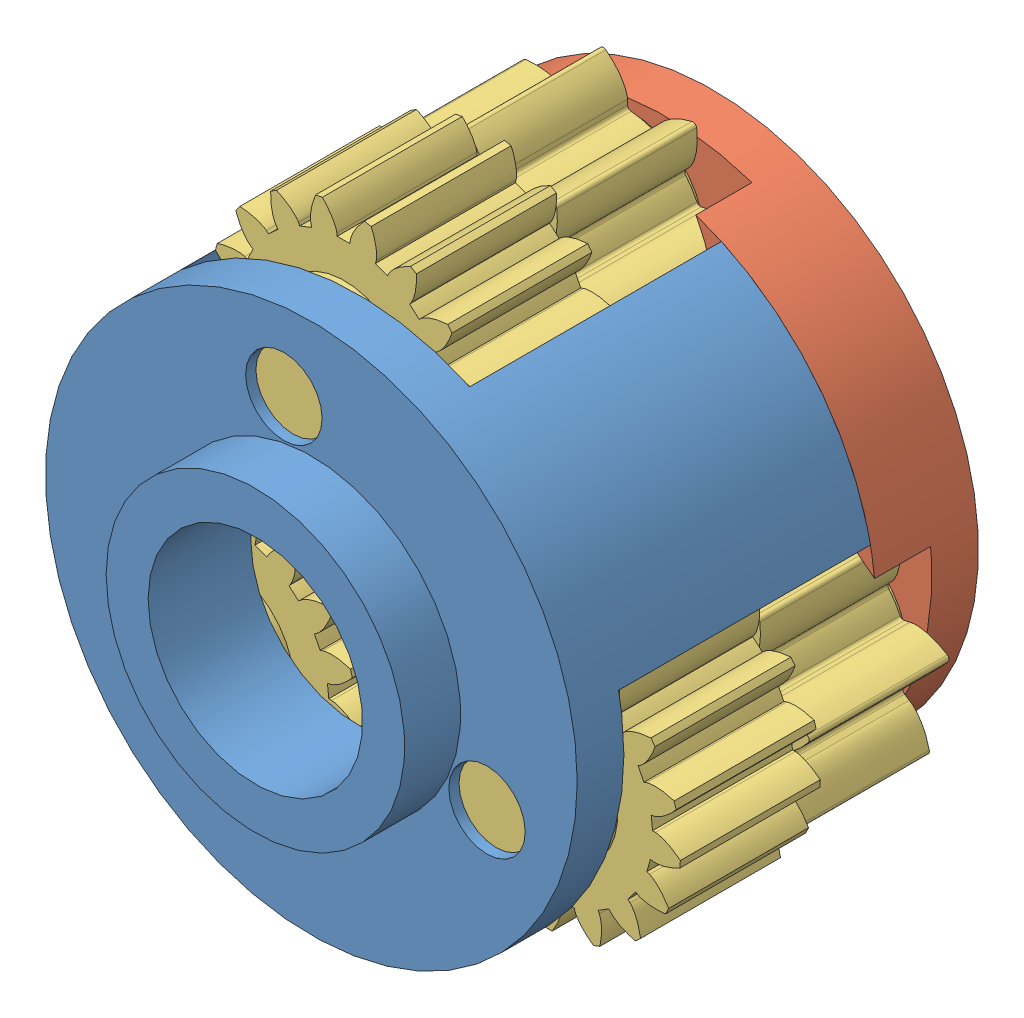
SolidWorks assembly Train Epicycloidale.SLDASM, configuration Default (file format 11000). Lengths in mm.
Overall size (6.31 6.26 5).
5 component instances, 3 part files, 9 mates.
Components (placement in the parent):
- porte satellite1-1: porte satellite1.SLDPRT [Défaut] at (-4.347 -5.3728 1.7604) size (5.7 5.7 5)
- porte satellite 2a-1: porte satellite 2a.SLDPRT [Défaut] at (-4.347 -5.3728 1.7604) size (5.7 5.7 1.1)
- SATELITE17X8a-1: SATELITE17X8a.SLDPRT [Défaut] at (-4.347 -5.3728 1.7604) size (2.84 2.83 4.1)
- SATELITE17X8a-2: SATELITE17X8a.SLDPRT [Défaut] at (-7.817 -5.8833 1.7604) size (2.84 2.83 4.1)
- SATELITE17X8a-3: SATELITE17X8a.SLDPRT [Défaut] at (-6.5241 -2.6229 1.7604) size (2.84 2.83 4.1)
Mates (geometry in assembly coordinates):
- Coaxiale1: concentric: cylinder of porte satellite1-1 through (-6.392 -4.5618 5.4104) axis (0 0 -1) radius 0.355; cylinder of porte satellite 2a-1 through (-6.392 -4.5618 4.3104) axis (0 0 -1) radius 0.35
- Coaxiale2: concentric: cylinder of porte satellite1-1 through (-2.6221 -4.0072 5.4104) axis (0 0 -1) radius 0.355; cylinder of porte satellite 2a-1 through (-2.6221 -4.0072 4.3104) axis (0 0 -1) radius 0.35
- Coaxiale3: concentric: cylinder of porte satellite1-1 through (-5.9346 -6.6298 8.1104) axis (0 0 -1) radius 0.41; cylinder of SATELITE17X8a-2 through (-5.9346 -6.6298 8.5104) axis (0 0 -1) radius 0.4
- Coaxiale4: concentric: cylinder of porte satellite1-1 through (-4.6417 -3.3694 8.1104) axis (0 0 -1) radius 0.41; cylinder of SATELITE17X8a-3 through (-4.6417 -3.3694 8.5104) axis (0 0 -1) radius 0.4
- Coaxiale5: concentric: cylinder of porte satellite1-1 through (-2.4646 -6.1193 8.1104) axis (0 0 -1) radius 0.41; cylinder of SATELITE17X8a-1 through (-2.4646 -6.1193 8.5104) axis (0 0 -1) radius 0.4
- Coïncidente7: coincident: plane of SATELITE17X8a-1 through (-1.7146 -6.1193 8.0604) normal (0 0 1); plane of SATELITE17X8a-3 through (-3.8917 -3.3694 8.0604) normal (0 0 1)
- Coïncidente8: coincident: plane of SATELITE17X8a-2 through (-5.1846 -6.6298 8.0604) normal (0 0 1); plane of SATELITE17X8a-3 through (-3.8917 -3.3694 8.0604) normal (0 0 1)
- Distance1: distance = 0.05 mm: plane of SATELITE17X8a-3 through (-3.8917 -3.3694 8.0604) normal (0 0 1); plane of porte satellite1-1 through (-4.4943 -4.3711 8.1104) normal (0 0 -1)
- Coïncidente10: coincident: plane of porte satellite1-1 through (-5.1408 -6.0013 5.4104) normal (0 0 -1); plane of porte satellite 2a-1 through (-1.497 -5.3728 5.4104) normal (0 0 1)
